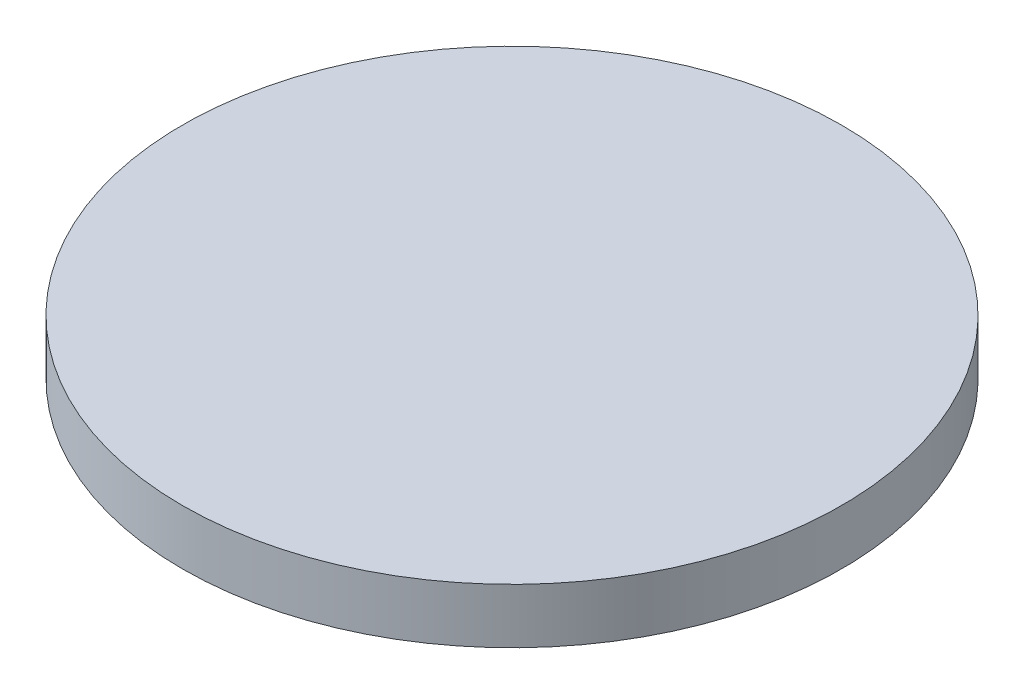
from build123d import *

# Parameters (mm, degrees)
SKETCH1_R           = 15
BOSS_EXTRUDE1_DEPTH = 2.5


with BuildPart() as part:
    # Sketch1 → Boss-Extrude1 (new body)
    with BuildSketch(Plane(origin=(0, 0, 0), x_dir=(1, 0, 0), z_dir=(0, 1, 0))):
        with Locations(Location((0, 0, 0), (0, 0, 270))):
            Circle(SKETCH1_R)
    extrude(amount=BOSS_EXTRUDE1_DEPTH)


solid = part.part
